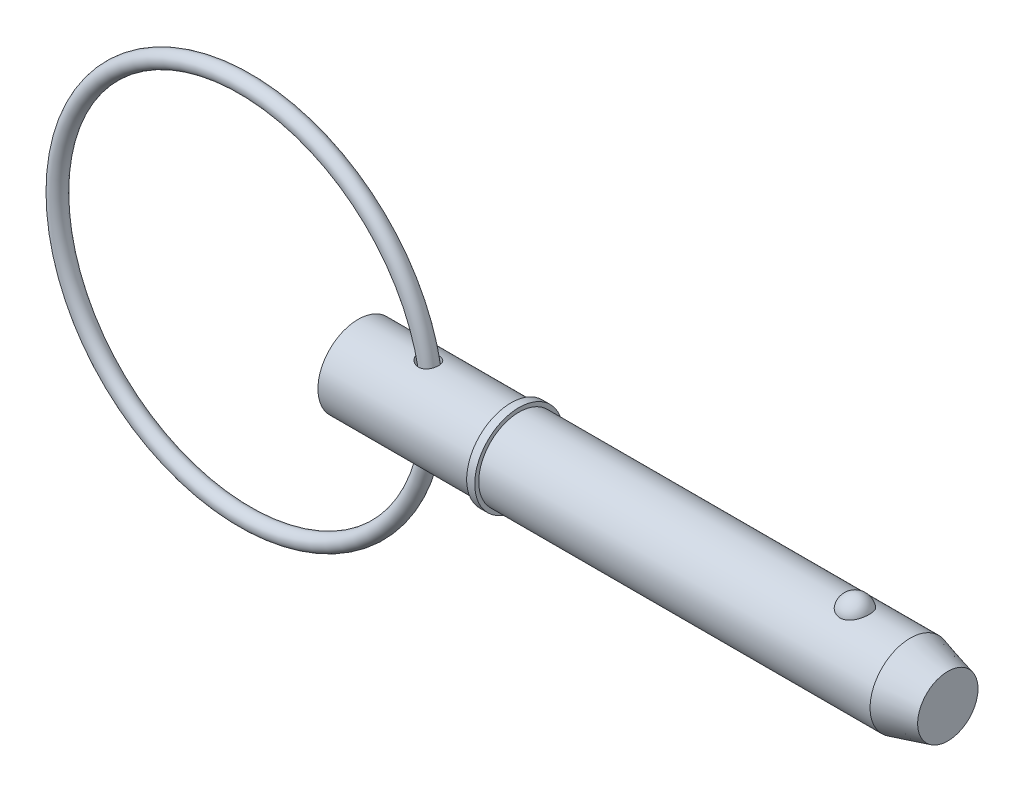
ISO-10303-21;
HEADER;
FILE_DESCRIPTION(('STEP AP214'),'2;1');
FILE_NAME('part.step','',(''),(''),'','','');
FILE_SCHEMA(('AUTOMOTIVE_DESIGN { 1 0 10303 214 1 1 1 1 }'));
ENDSEC;
DATA;
#1=APPLICATION_CONTEXT('core data for automotive mechanical design processes');
#2=APPLICATION_PROTOCOL_DEFINITION('international standard','automotive_design',2000,#1);
#3=PRODUCT_CONTEXT('',#1,'mechanical');
#4=PRODUCT('Part','Part','',(#3));
#5=PRODUCT_RELATED_PRODUCT_CATEGORY('part','',(#4));
#6=PRODUCT_DEFINITION_FORMATION('','',#4);
#7=PRODUCT_DEFINITION_CONTEXT('part definition',#1,'design');
#8=PRODUCT_DEFINITION('design','',#6,#7);
#9=PRODUCT_DEFINITION_SHAPE('','',#8);
#10=(LENGTH_UNIT() NAMED_UNIT(*) SI_UNIT(.MILLI.,.METRE.));
#11=(NAMED_UNIT(*) PLANE_ANGLE_UNIT() SI_UNIT($,.RADIAN.));
#12=(NAMED_UNIT(*) SI_UNIT($,.STERADIAN.) SOLID_ANGLE_UNIT());
#13=UNCERTAINTY_MEASURE_WITH_UNIT(LENGTH_MEASURE(1.E-05),#10,'distance_accuracy_value','');
#14=(GEOMETRIC_REPRESENTATION_CONTEXT(3) GLOBAL_UNCERTAINTY_ASSIGNED_CONTEXT((#13)) GLOBAL_UNIT_ASSIGNED_CONTEXT((#10,
#11,#12)) REPRESENTATION_CONTEXT('',''));
#15=CARTESIAN_POINT('',(0.,0.,0.));
#16=DIRECTION('',(0.,0.,1.));
#17=DIRECTION('',(1.,0.,0.));
#18=AXIS2_PLACEMENT_3D('',#15,#16,#17);
#19=CARTESIAN_POINT('',(-13.4013067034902,0.,0.));
#20=DIRECTION('',(0.,0.,1.));
#21=DIRECTION('',(1.,0.,0.));
#22=AXIS2_PLACEMENT_3D('',#19,#20,#21);
#23=TOROIDAL_SURFACE('',#22,22.225,0.952999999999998);
#24=CARTESIAN_POINT('',(9.77669329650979,0.,0.));
#25=VERTEX_POINT('',#24);
#26=VERTEX_LOOP('',#25);
#27=FACE_BOUND('',#26,.T.);
#28=ADVANCED_FACE('P0_F12',(#27),#23,.T.);
#29=CLOSED_SHELL('',(#28));
#30=MANIFOLD_SOLID_BREP('P0_B1',#29);
#31=CARTESIAN_POINT('',(0.,0.,0.));
#32=DIRECTION('',(1.,0.,0.));
#33=DIRECTION('',(0.,0.,-1.));
#34=AXIS2_PLACEMENT_3D('',#31,#32,#33);
#35=CYLINDRICAL_SURFACE('',#34,4.765);
#36=CARTESIAN_POINT('',(7.48459594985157,4.685973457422,-0.864220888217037));
#37=CARTESIAN_POINT('',(7.53849733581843,4.67711144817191,-0.912273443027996));
#38=CARTESIAN_POINT('',(7.59654891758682,4.66833039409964,-0.955745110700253));
#39=CARTESIAN_POINT('',(7.71924602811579,4.65195567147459,-1.03251233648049));
#40=CARTESIAN_POINT('',(7.78389917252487,4.64436340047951,-1.06579596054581));
#41=CARTESIAN_POINT('',(7.91808098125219,4.63129108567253,-1.12124172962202));
#42=CARTESIAN_POINT('',(7.98761280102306,4.62581242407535,-1.14339659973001));
#43=CARTESIAN_POINT('',(8.12956198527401,4.61771699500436,-1.17566870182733));
#44=CARTESIAN_POINT('',(8.20197774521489,4.61509865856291,-1.18579253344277));
#45=CARTESIAN_POINT('',(8.34550810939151,4.6131791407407,-1.19323853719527));
#46=CARTESIAN_POINT('',(8.41660306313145,4.61378793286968,-1.19090812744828));
#47=CARTESIAN_POINT('',(8.55721866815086,4.61812874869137,-1.17396277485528));
#48=CARTESIAN_POINT('',(8.62673979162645,4.62185982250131,-1.15935156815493));
#49=CARTESIAN_POINT('',(8.75801373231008,4.63172632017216,-1.11925454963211));
#50=CARTESIAN_POINT('',(8.81998342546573,4.63771186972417,-1.09443918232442));
#51=CARTESIAN_POINT('',(8.93863698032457,4.65140179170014,-1.03470792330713));
#52=CARTESIAN_POINT('',(8.99532131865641,4.65910600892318,-0.999792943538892));
#53=CARTESIAN_POINT('',(9.10080884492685,4.67519705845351,-0.921583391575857));
#54=CARTESIAN_POINT('',(9.14973848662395,4.68356861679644,-0.878455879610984));
#55=CARTESIAN_POINT('',(9.23971126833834,4.70019813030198,-0.784620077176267));
#56=CARTESIAN_POINT('',(9.28075401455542,4.7084560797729,-0.733911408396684));
#57=CARTESIAN_POINT('',(9.35441071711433,4.7240688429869,-0.62563775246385));
#58=CARTESIAN_POINT('',(9.38691359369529,4.73141115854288,-0.567995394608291));
#59=CARTESIAN_POINT('',(9.44203216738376,4.74427907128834,-0.447974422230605));
#60=CARTESIAN_POINT('',(9.46464743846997,4.74980459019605,-0.385595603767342));
#61=CARTESIAN_POINT('',(9.49961110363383,4.75848927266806,-0.257248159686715));
#62=CARTESIAN_POINT('',(9.51186382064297,4.76162635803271,-0.191251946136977));
#63=CARTESIAN_POINT('',(9.52545294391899,4.76511165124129,-0.0580729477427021));
#64=CARTESIAN_POINT('',(9.52678936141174,4.76545986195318,0.00910983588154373));
#65=CARTESIAN_POINT('',(9.51851557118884,4.76333054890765,0.142723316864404));
#66=CARTESIAN_POINT('',(9.50891008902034,4.76085424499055,0.209154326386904));
#67=CARTESIAN_POINT('',(9.47899306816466,4.75334441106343,0.339411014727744));
#68=CARTESIAN_POINT('',(9.45868126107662,4.74831081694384,0.403236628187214));
#69=CARTESIAN_POINT('',(9.4078294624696,4.73622777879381,0.526509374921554));
#70=CARTESIAN_POINT('',(9.37728413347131,4.72917728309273,0.585954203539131));
#71=CARTESIAN_POINT('',(9.30671117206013,4.71383320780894,0.698745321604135));
#72=CARTESIAN_POINT('',(9.26668347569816,4.70553961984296,0.752091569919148));
#73=CARTESIAN_POINT('',(9.17821531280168,4.68864637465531,0.851083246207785));
#74=CARTESIAN_POINT('',(9.12978756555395,4.68004719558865,0.896740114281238));
#75=CARTESIAN_POINT('',(9.02575872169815,4.66350833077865,0.97912505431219));
#76=CARTESIAN_POINT('',(8.97015856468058,4.65556855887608,1.01585429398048));
#77=CARTESIAN_POINT('',(8.85409306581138,4.6413534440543,1.0789347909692));
#78=CARTESIAN_POINT('',(8.79369898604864,4.63505812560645,1.10541268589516));
#79=CARTESIAN_POINT('',(8.66918290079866,4.62469916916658,1.1479836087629));
#80=CARTESIAN_POINT('',(8.60506121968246,4.62063533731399,1.1640775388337));
#81=CARTESIAN_POINT('',(8.47537782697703,4.61517348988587,1.18554696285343));
#82=CARTESIAN_POINT('',(8.4098281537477,4.61375835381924,1.19099130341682));
#83=CARTESIAN_POINT('',(8.2786938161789,4.61362908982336,1.19149080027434));
#84=CARTESIAN_POINT('',(8.21310914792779,4.61491539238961,1.18654430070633));
#85=CARTESIAN_POINT('',(8.08152457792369,4.62006017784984,1.16635311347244));
#86=CARTESIAN_POINT('',(8.01557748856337,4.62399895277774,1.15078675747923));
#87=CARTESIAN_POINT('',(7.88704537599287,4.63403793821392,1.10966738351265));
#88=CARTESIAN_POINT('',(7.82446148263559,4.64013886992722,1.08411103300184));
#89=CARTESIAN_POINT('',(7.70057947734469,4.65423592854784,1.02195168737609));
#90=CARTESIAN_POINT('',(7.63957197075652,4.66232221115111,0.984788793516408));
#91=CARTESIAN_POINT('',(7.52457021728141,4.67924552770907,0.900950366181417));
#92=CARTESIAN_POINT('',(7.47057819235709,4.68808279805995,0.854271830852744));
#93=CARTESIAN_POINT('',(7.37028930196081,4.70567913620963,0.751386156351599));
#94=CARTESIAN_POINT('',(7.32416327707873,4.7144333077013,0.695010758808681));
#95=CARTESIAN_POINT('',(7.24276674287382,4.73060166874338,0.574719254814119));
#96=CARTESIAN_POINT('',(7.20749051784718,4.73801656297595,0.510807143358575));
#97=CARTESIAN_POINT('',(7.15148495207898,4.75009927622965,0.381705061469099));
#98=CARTESIAN_POINT('',(7.12994463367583,4.7549169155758,0.31688231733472));
#99=CARTESIAN_POINT('',(7.09904467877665,4.76189692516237,0.184270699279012));
#100=CARTESIAN_POINT('',(7.08967554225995,4.76406136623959,0.116484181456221));
#101=CARTESIAN_POINT('',(7.08394150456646,4.76538257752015,-0.0133529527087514));
#102=CARTESIAN_POINT('',(7.0864533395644,4.76479916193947,-0.0753538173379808));
#103=CARTESIAN_POINT('',(7.10181380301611,4.76127985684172,-0.197993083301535));
#104=CARTESIAN_POINT('',(7.11466291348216,4.75834385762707,-0.258631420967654));
#105=CARTESIAN_POINT('',(7.14973937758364,4.75051877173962,-0.375744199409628));
#106=CARTESIAN_POINT('',(7.17178938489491,4.7456667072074,-0.432274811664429));
#107=CARTESIAN_POINT('',(7.22432962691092,4.73449674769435,-0.54107038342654));
#108=CARTESIAN_POINT('',(7.25481702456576,4.72817934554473,-0.593336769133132));
#109=CARTESIAN_POINT('',(7.31700895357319,4.71588241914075,-0.683642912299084));
#110=CARTESIAN_POINT('',(7.34750058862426,4.7100477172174,-0.722547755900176));
#111=CARTESIAN_POINT('',(7.41288050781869,4.69812059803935,-0.796421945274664));
#112=CARTESIAN_POINT('',(7.44776960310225,4.69202813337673,-0.831390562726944));
#113=CARTESIAN_POINT('',(7.48459594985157,4.685973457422,-0.864220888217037));
#114=B_SPLINE_CURVE_WITH_KNOTS('',3,(#36,#37,#38,#39,#40,#41,#42,#43,#44,#45,#46,#47,#48,#49,
#50,#51,#52,#53,#54,#55,#56,#57,#58,#59,#60,#61,#62,#63,#64,#65,#66,#67,#68,#69,#70,#71,#72,#73,
#74,#75,#76,#77,#78,#79,#80,#81,#82,#83,#84,#85,#86,#87,#88,#89,#90,#91,#92,#93,#94,#95,#96,#97,
#98,#99,#100,#101,#102,#103,#104,#105,#106,#107,#108,#109,#110,#111,#112,#113),.UNSPECIFIED.,
.T.,.F.,(4,2,2,2,2,2,2,2,2,2,2,2,2,2,2,2,2,2,2,2,2,2,2,2,2,2,2,2,2,2,2,2,2,2,2,2,2,2,4),(0.,
0.218078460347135,0.436411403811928,0.654886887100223,0.873242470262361,1.08553925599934,
1.2977714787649,1.49785367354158,1.6979178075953,1.8942789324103,2.09064985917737,
2.28946102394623,2.48828075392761,2.68891673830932,2.88955251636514,3.09010167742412,
3.29065586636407,3.49131482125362,3.69197512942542,3.89233421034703,4.09266707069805,
4.29043955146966,4.48819484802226,4.68466743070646,4.8811713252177,5.08390806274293,
5.28671248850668,5.50140943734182,5.71617422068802,5.93513249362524,6.15397522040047,
6.35827356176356,6.56241234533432,6.74765856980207,6.93291343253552,7.11475139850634,
7.29652829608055,7.44549570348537,7.59449062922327),.UNSPECIFIED.);
#115=CARTESIAN_POINT('',(7.48459594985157,4.685973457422,-0.864220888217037));
#116=VERTEX_POINT('',#115);
#117=EDGE_CURVE('P1_E42',#116,#116,#114,.T.);
#118=ORIENTED_EDGE('',*,*,#117,.T.);
#119=EDGE_LOOP('',(#118));
#120=FACE_BOUND('',#119,.T.);
#121=CARTESIAN_POINT('',(0.,0.,0.));
#122=DIRECTION('',(1.,0.,0.));
#123=DIRECTION('',(0.,0.,-1.));
#124=AXIS2_PLACEMENT_3D('',#121,#122,#123);
#125=CIRCLE('',#124,4.765);
#126=CARTESIAN_POINT('',(0.,0.,-4.765));
#127=VERTEX_POINT('',#126);
#128=EDGE_CURVE('P1_E9',#127,#127,#125,.T.);
#129=ORIENTED_EDGE('',*,*,#128,.T.);
#130=EDGE_LOOP('',(#129));
#131=FACE_BOUND('',#130,.T.);
#132=CARTESIAN_POINT('',(18.097,0.,0.));
#133=DIRECTION('',(1.,0.,0.));
#134=DIRECTION('',(0.,0.,-1.));
#135=AXIS2_PLACEMENT_3D('',#132,#133,#134);
#136=CIRCLE('',#135,4.765);
#137=CARTESIAN_POINT('',(18.097,0.,-4.765));
#138=VERTEX_POINT('',#137);
#139=EDGE_CURVE('P1_E25',#138,#138,#136,.T.);
#140=ORIENTED_EDGE('',*,*,#139,.F.);
#141=EDGE_LOOP('',(#140));
#142=FACE_BOUND('',#141,.T.);
#143=CARTESIAN_POINT('',(7.48459594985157,-4.685973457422,-0.864220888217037));
#144=CARTESIAN_POINT('',(7.43440944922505,-4.6942250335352,-0.819477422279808));
#145=CARTESIAN_POINT('',(7.38778663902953,-4.70255210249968,-0.77073361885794));
#146=CARTESIAN_POINT('',(7.3030968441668,-4.7184989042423,-0.666172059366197));
#147=CARTESIAN_POINT('',(7.26503010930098,-4.72611861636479,-0.610354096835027));
#148=CARTESIAN_POINT('',(7.19878266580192,-4.73983819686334,-0.492624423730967));
#149=CARTESIAN_POINT('',(7.17064194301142,-4.74593188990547,-0.430689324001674));
#150=CARTESIAN_POINT('',(7.12584349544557,-4.75581281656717,-0.3026233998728));
#151=CARTESIAN_POINT('',(7.10917889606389,-4.75960143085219,-0.236495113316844));
#152=CARTESIAN_POINT('',(7.0889853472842,-4.76421379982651,-0.106818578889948));
#153=CARTESIAN_POINT('',(7.0846333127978,-4.76522320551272,-0.0434047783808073));
#154=CARTESIAN_POINT('',(7.08693064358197,-4.7646936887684,0.0832041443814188));
#155=CARTESIAN_POINT('',(7.09357756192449,-4.76315533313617,0.146399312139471));
#156=CARTESIAN_POINT('',(7.11694629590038,-4.75784365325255,0.267709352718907));
#157=CARTESIAN_POINT('',(7.13318365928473,-4.75417793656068,0.325923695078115));
#158=CARTESIAN_POINT('',(7.17459606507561,-4.74508048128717,0.438922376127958));
#159=CARTESIAN_POINT('',(7.19977257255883,-4.73964845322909,0.493706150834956));
#160=CARTESIAN_POINT('',(7.25946789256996,-4.72725615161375,0.60111049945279));
#161=CARTESIAN_POINT('',(7.2943661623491,-4.72023663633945,0.653512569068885));
#162=CARTESIAN_POINT('',(7.37173226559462,-4.70550732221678,0.752279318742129));
#163=CARTESIAN_POINT('',(7.41420315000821,-4.69779724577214,0.798641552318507));
#164=CARTESIAN_POINT('',(7.50982312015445,-4.6816641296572,0.888551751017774));
#165=CARTESIAN_POINT('',(7.56359853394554,-4.67324162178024,0.931434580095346));
#166=CARTESIAN_POINT('',(7.67736628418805,-4.65728554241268,1.00819498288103));
#167=CARTESIAN_POINT('',(7.7373611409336,-4.64975233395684,1.04206888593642));
#168=CARTESIAN_POINT('',(7.86574076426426,-4.63599923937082,1.10169445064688));
#169=CARTESIAN_POINT('',(7.93441048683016,-4.62988111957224,1.12685968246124));
#170=CARTESIAN_POINT('',(8.07519000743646,-4.62035710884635,1.16529928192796));
#171=CARTESIAN_POINT('',(8.14729925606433,-4.61695078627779,1.1785755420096));
#172=CARTESIAN_POINT('',(8.29111621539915,-4.61341807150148,1.19232949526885));
#173=CARTESIAN_POINT('',(8.36279361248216,-4.61321655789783,1.19310032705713));
#174=CARTESIAN_POINT('',(8.50512944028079,-4.61602317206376,1.1821962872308));
#175=CARTESIAN_POINT('',(8.57578827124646,-4.61903000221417,1.17052644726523));
#176=CARTESIAN_POINT('',(8.70965757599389,-4.62766311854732,1.13589249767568));
#177=CARTESIAN_POINT('',(8.77306169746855,-4.63312492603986,1.11363308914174));
#178=CARTESIAN_POINT('',(8.8949702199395,-4.64598463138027,1.05869880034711));
#179=CARTESIAN_POINT('',(8.95347516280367,-4.65338231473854,1.02602507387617));
#180=CARTESIAN_POINT('',(9.06253415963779,-4.66906009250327,0.952097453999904));
#181=CARTESIAN_POINT('',(9.11324728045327,-4.67731427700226,0.911072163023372));
#182=CARTESIAN_POINT('',(9.20707850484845,-4.69393979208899,0.821122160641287));
#183=CARTESIAN_POINT('',(9.25019629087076,-4.70231112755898,0.772197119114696));
#184=CARTESIAN_POINT('',(9.32819072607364,-4.71835356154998,0.667239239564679));
#185=CARTESIAN_POINT('',(9.36297449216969,-4.72601623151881,0.611136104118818));
#186=CARTESIAN_POINT('',(9.42286382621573,-4.73971239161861,0.493799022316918));
#187=CARTESIAN_POINT('',(9.44796891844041,-4.74574580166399,0.432564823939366));
#188=CARTESIAN_POINT('',(9.48811605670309,-4.75559286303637,0.305990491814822));
#189=CARTESIAN_POINT('',(9.50304870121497,-4.75938232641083,0.240613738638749));
#190=CARTESIAN_POINT('',(9.5220569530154,-4.76423188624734,0.108201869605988));
#191=CARTESIAN_POINT('',(9.52613255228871,-4.76529198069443,0.0411667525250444));
#192=CARTESIAN_POINT('',(9.52332772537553,-4.76456884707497,-0.0926701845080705));
#193=CARTESIAN_POINT('',(9.51644541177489,-4.76278512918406,-0.159471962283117));
#194=CARTESIAN_POINT('',(9.49188827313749,-4.75656536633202,-0.290934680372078));
#195=CARTESIAN_POINT('',(9.47421322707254,-4.75212926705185,-0.355595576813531));
#196=CARTESIAN_POINT('',(9.42849503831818,-4.74108318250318,-0.480955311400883));
#197=CARTESIAN_POINT('',(9.4004503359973,-4.73447287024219,-0.541653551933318));
#198=CARTESIAN_POINT('',(9.33467290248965,-4.71979928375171,-0.657361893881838));
#199=CARTESIAN_POINT('',(9.29694000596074,-4.71173598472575,-0.712371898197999));
#200=CARTESIAN_POINT('',(9.2127449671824,-4.69505469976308,-0.815106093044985));
#201=CARTESIAN_POINT('',(9.1662875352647,-4.68643701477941,-0.862834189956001));
#202=CARTESIAN_POINT('',(9.06584125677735,-4.66961864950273,-0.949656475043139));
#203=CARTESIAN_POINT('',(9.01185326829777,-4.66141792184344,-0.98875164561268));
#204=CARTESIAN_POINT('',(8.8985010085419,-4.64646376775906,-1.0567894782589));
#205=CARTESIAN_POINT('',(8.83920621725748,-4.63969468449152,-1.08584444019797));
#206=CARTESIAN_POINT('',(8.71642097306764,-4.62824519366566,-1.13365785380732));
#207=CARTESIAN_POINT('',(8.65293102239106,-4.623564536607,-1.15241753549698));
#208=CARTESIAN_POINT('',(8.52421291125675,-4.61681938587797,-1.17914952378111));
#209=CARTESIAN_POINT('',(8.45900634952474,-4.6147310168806,-1.18722032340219));
#210=CARTESIAN_POINT('',(8.32811210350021,-4.61325848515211,-1.19292878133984));
#211=CARTESIAN_POINT('',(8.26242433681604,-4.61387479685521,-1.19056460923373));
#212=CARTESIAN_POINT('',(8.13057358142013,-4.6177227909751,-1.17555160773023));
#213=CARTESIAN_POINT('',(8.06444352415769,-4.62102282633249,-1.16263394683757));
#214=CARTESIAN_POINT('',(7.93513143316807,-4.62989870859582,-1.12676570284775));
#215=CARTESIAN_POINT('',(7.87194976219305,-4.6354748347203,-1.10381388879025));
#216=CARTESIAN_POINT('',(7.75155849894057,-4.64811746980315,-1.04928030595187));
#217=CARTESIAN_POINT('',(7.69423767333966,-4.65514232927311,-1.01793362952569));
#218=CARTESIAN_POINT('',(7.58503138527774,-4.67007903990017,-0.947046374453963));
#219=CARTESIAN_POINT('',(7.53314612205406,-4.67799092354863,-0.907505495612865));
#220=CARTESIAN_POINT('',(7.48459594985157,-4.685973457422,-0.864220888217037));
#221=B_SPLINE_CURVE_WITH_KNOTS('',3,(#143,#144,#145,#146,#147,#148,#149,#150,#151,#152,#153,
#154,#155,#156,#157,#158,#159,#160,#161,#162,#163,#164,#165,#166,#167,#168,#169,#170,#171,#172,
#173,#174,#175,#176,#177,#178,#179,#180,#181,#182,#183,#184,#185,#186,#187,#188,#189,#190,#191,
#192,#193,#194,#195,#196,#197,#198,#199,#200,#201,#202,#203,#204,#205,#206,#207,#208,#209,#210,
#211,#212,#213,#214,#215,#216,#217,#218,#219,#220),.UNSPECIFIED.,.T.,.F.,(4,2,2,2,2,2,2,2,2,2,2,
2,2,2,2,2,2,2,2,2,2,2,2,2,2,2,2,2,2,2,2,2,2,2,2,2,2,2,4),(0.,0.203013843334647,
0.406033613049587,0.609862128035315,0.813568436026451,1.0032929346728,1.19297523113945,
1.37380897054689,1.55467236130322,1.74393241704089,1.93326889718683,2.14025373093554,
2.3473227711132,2.566425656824,2.78549366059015,2.9994188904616,3.21325763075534,
3.41451842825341,3.61575693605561,3.81208930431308,4.00842987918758,4.20686629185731,
4.40531245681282,4.60586051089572,4.80640871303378,5.0069914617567,5.20757831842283,
5.40819535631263,5.60881581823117,5.80932827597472,6.00981790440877,6.2079863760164,
6.40613116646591,6.60243714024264,6.79877754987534,7.00028133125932,7.20180983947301,
7.39819723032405,7.59459181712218),.UNSPECIFIED.);
#222=CARTESIAN_POINT('',(7.48459594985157,-4.685973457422,-0.864220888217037));
#223=VERTEX_POINT('',#222);
#224=EDGE_CURVE('P1_E17',#223,#223,#221,.T.);
#225=ORIENTED_EDGE('',*,*,#224,.T.);
#226=EDGE_LOOP('',(#225));
#227=FACE_BOUND('',#226,.T.);
#228=ADVANCED_FACE('P1_F13',(#120,#131,#142,#227),#35,.T.);
#229=CARTESIAN_POINT('',(0.,0.,0.));
#230=DIRECTION('',(1.,0.,0.));
#231=DIRECTION('',(0.,0.,-1.));
#232=AXIS2_PLACEMENT_3D('',#229,#230,#231);
#233=CYLINDRICAL_SURFACE('',#232,4.765);
#234=CARTESIAN_POINT('',(65.4041944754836,0.,0.));
#235=DIRECTION('',(1.,0.,0.));
#236=DIRECTION('',(0.,0.,-1.));
#237=AXIS2_PLACEMENT_3D('',#234,#235,#236);
#238=CIRCLE('',#237,4.765);
#239=CARTESIAN_POINT('',(65.4041944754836,0.,-4.765));
#240=VERTEX_POINT('',#239);
#241=EDGE_CURVE('P1_E99',#240,#240,#238,.T.);
#242=ORIENTED_EDGE('',*,*,#241,.F.);
#243=EDGE_LOOP('',(#242));
#244=FACE_BOUND('',#243,.T.);
#245=CARTESIAN_POINT('',(19.05,0.,0.));
#246=DIRECTION('',(1.,0.,0.));
#247=DIRECTION('',(0.,0.,-1.));
#248=AXIS2_PLACEMENT_3D('',#245,#246,#247);
#249=CIRCLE('',#248,4.765);
#250=CARTESIAN_POINT('',(19.05,0.,-4.765));
#251=VERTEX_POINT('',#250);
#252=EDGE_CURVE('P1_E96',#251,#251,#249,.T.);
#253=ORIENTED_EDGE('',*,*,#252,.T.);
#254=EDGE_LOOP('',(#253));
#255=FACE_BOUND('',#254,.T.);
#256=CARTESIAN_POINT('',(58.8510202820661,4.42764777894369,1.76101111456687));
#257=CARTESIAN_POINT('',(58.7597212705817,4.42764470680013,1.76101422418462));
#258=CARTESIAN_POINT('',(58.6684468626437,4.4305909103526,1.75366340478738));
#259=CARTESIAN_POINT('',(58.4886154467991,4.44201846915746,1.72451180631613));
#260=CARTESIAN_POINT('',(58.4000577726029,4.45049845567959,1.70271460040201));
#261=CARTESIAN_POINT('',(58.2282570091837,4.47200516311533,1.6453937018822));
#262=CARTESIAN_POINT('',(58.1450064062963,4.48502527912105,1.60988994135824));
#263=CARTESIAN_POINT('',(57.9857633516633,4.51419542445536,1.52617873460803));
#264=CARTESIAN_POINT('',(57.9097723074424,4.53034605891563,1.47796883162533));
#265=CARTESIAN_POINT('',(57.764744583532,4.5645931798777,1.36860494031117));
#266=CARTESIAN_POINT('',(57.6959645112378,4.58273170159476,1.3071242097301));
#267=CARTESIAN_POINT('',(57.5693423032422,4.61870302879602,1.17370204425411));
#268=CARTESIAN_POINT('',(57.5115021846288,4.63653577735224,1.10175868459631));
#269=CARTESIAN_POINT('',(57.405570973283,4.67090140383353,0.945806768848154));
#270=CARTESIAN_POINT('',(57.3580305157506,4.68734068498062,0.861402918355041));
#271=CARTESIAN_POINT('',(57.2770817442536,4.71628466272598,0.685442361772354));
#272=CARTESIAN_POINT('',(57.2436747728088,4.72878898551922,0.593884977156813));
#273=CARTESIAN_POINT('',(57.191287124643,4.74874061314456,0.404781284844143));
#274=CARTESIAN_POINT('',(57.1725178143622,4.75611366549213,0.307168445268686));
#275=CARTESIAN_POINT('',(57.1505846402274,4.76475393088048,0.109940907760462));
#276=CARTESIAN_POINT('',(57.1474205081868,4.76602124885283,0.0103262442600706));
#277=CARTESIAN_POINT('',(57.1567405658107,4.76232928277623,-0.187629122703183));
#278=CARTESIAN_POINT('',(57.1691588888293,4.7573962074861,-0.285973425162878));
#279=CARTESIAN_POINT('',(57.2092804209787,4.74184975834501,-0.479027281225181));
#280=CARTESIAN_POINT('',(57.2369839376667,4.7312362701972,-0.573736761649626));
#281=CARTESIAN_POINT('',(57.3071581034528,4.70540026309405,-0.756973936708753));
#282=CARTESIAN_POINT('',(57.3496460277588,4.69017235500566,-0.845494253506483));
#283=CARTESIAN_POINT('',(57.448520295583,4.6566986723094,-1.01378033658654));
#284=CARTESIAN_POINT('',(57.5049076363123,4.63845268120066,-1.09354547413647));
#285=CARTESIAN_POINT('',(57.630552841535,4.60085438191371,-1.24228523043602));
#286=CARTESIAN_POINT('',(57.6998439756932,4.58149930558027,-1.31123108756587));
#287=CARTESIAN_POINT('',(57.8496066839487,4.54391653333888,-1.43607409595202));
#288=CARTESIAN_POINT('',(57.9300771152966,4.52568872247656,-1.49197257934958));
#289=CARTESIAN_POINT('',(58.0981500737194,4.49293007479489,-1.58786764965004));
#290=CARTESIAN_POINT('',(58.1855445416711,4.47832346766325,-1.62820219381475));
#291=CARTESIAN_POINT('',(58.366553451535,4.45406011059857,-1.69345757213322));
#292=CARTESIAN_POINT('',(58.4601655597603,4.44440151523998,-1.71838415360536));
#293=CARTESIAN_POINT('',(58.6458939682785,4.43159888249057,-1.7511284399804));
#294=CARTESIAN_POINT('',(58.737849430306,4.42815213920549,-1.75974223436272));
#295=CARTESIAN_POINT('',(58.9219658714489,4.427247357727,-1.76201865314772));
#296=CARTESIAN_POINT('',(59.0141268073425,4.42978816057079,-1.75568417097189));
#297=CARTESIAN_POINT('',(59.1931292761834,4.4403864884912,-1.72869560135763));
#298=CARTESIAN_POINT('',(59.2800474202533,4.44827555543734,-1.70847853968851));
#299=CARTESIAN_POINT('',(59.4491314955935,4.46852246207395,-1.65479562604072));
#300=CARTESIAN_POINT('',(59.5312970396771,4.48088066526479,-1.62132869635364));
#301=CARTESIAN_POINT('',(59.6905916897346,4.50907357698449,-1.54120560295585));
#302=CARTESIAN_POINT('',(59.7675700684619,4.52497884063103,-1.49427526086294));
#303=CARTESIAN_POINT('',(59.9127080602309,4.55845148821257,-1.38881222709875));
#304=CARTESIAN_POINT('',(59.9808656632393,4.57601924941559,-1.33027689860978));
#305=CARTESIAN_POINT('',(60.1100990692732,4.61196537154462,-1.19991049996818));
#306=CARTESIAN_POINT('',(60.1706562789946,4.63034074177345,-1.12756415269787));
#307=CARTESIAN_POINT('',(60.2792797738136,4.66513959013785,-0.973612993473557));
#308=CARTESIAN_POINT('',(60.3273438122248,4.68156271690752,-0.892006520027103));
#309=CARTESIAN_POINT('',(60.411383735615,4.71130224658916,-0.718892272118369));
#310=CARTESIAN_POINT('',(60.4469185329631,4.724501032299,-0.627149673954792));
#311=CARTESIAN_POINT('',(60.5029522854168,4.74571823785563,-0.438611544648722));
#312=CARTESIAN_POINT('',(60.523450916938,4.75373654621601,-0.341815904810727));
#313=CARTESIAN_POINT('',(60.5490338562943,4.76378905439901,-0.145633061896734));
#314=CARTESIAN_POINT('',(60.554076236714,4.76580697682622,-0.046239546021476));
#315=CARTESIAN_POINT('',(60.5485239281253,4.76360573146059,0.152038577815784));
#316=CARTESIAN_POINT('',(60.5379294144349,4.75938663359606,0.250923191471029));
#317=CARTESIAN_POINT('',(60.5013875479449,4.74516937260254,0.445004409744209));
#318=CARTESIAN_POINT('',(60.4754964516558,4.73519238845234,0.540213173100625));
#319=CARTESIAN_POINT('',(60.4089273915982,4.71049394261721,0.724662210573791));
#320=CARTESIAN_POINT('',(60.368248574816,4.69577220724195,0.813902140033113));
#321=CARTESIAN_POINT('',(60.2727177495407,4.66303767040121,0.984313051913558));
#322=CARTESIAN_POINT('',(60.2178042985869,4.64501070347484,1.06544688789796));
#323=CARTESIAN_POINT('',(60.0950496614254,4.60764678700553,1.21692673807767));
#324=CARTESIAN_POINT('',(60.0272086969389,4.58830985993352,1.28727293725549));
#325=CARTESIAN_POINT('',(59.8805480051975,4.55060370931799,1.41479271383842));
#326=CARTESIAN_POINT('',(59.8017918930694,4.53222967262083,1.4720378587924));
#327=CARTESIAN_POINT('',(59.6349890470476,4.49849576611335,1.57212016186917));
#328=CARTESIAN_POINT('',(59.5469417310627,4.48313608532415,1.6149564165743));
#329=CARTESIAN_POINT('',(59.3597918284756,4.45676184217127,1.68642657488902));
#330=CARTESIAN_POINT('',(59.2603653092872,4.44598302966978,1.71430590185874));
#331=CARTESIAN_POINT('',(59.0576210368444,4.43142918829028,1.7515925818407));
#332=CARTESIAN_POINT('',(58.9543049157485,4.42765125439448,1.76100759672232));
#333=CARTESIAN_POINT('',(58.8510202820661,4.42764777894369,1.76101111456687));
#334=B_SPLINE_CURVE_WITH_KNOTS('',3,(#256,#257,#258,#259,#260,#261,#262,#263,#264,#265,#266,
#267,#268,#269,#270,#271,#272,#273,#274,#275,#276,#277,#278,#279,#280,#281,#282,#283,#284,#285,
#286,#287,#288,#289,#290,#291,#292,#293,#294,#295,#296,#297,#298,#299,#300,#301,#302,#303,#304,
#305,#306,#307,#308,#309,#310,#311,#312,#313,#314,#315,#316,#317,#318,#319,#320,#321,#322,#323,
#324,#325,#326,#327,#328,#329,#330,#331,#332,#333),.UNSPECIFIED.,.T.,.F.,(4,2,2,2,2,2,2,2,2,2,2,
2,2,2,2,2,2,2,2,2,2,2,2,2,2,2,2,2,2,2,2,2,2,2,2,2,2,2,4),(0.,0.273517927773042,
0.546968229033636,0.820022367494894,1.09312934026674,1.37393946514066,1.6548013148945,
1.94820420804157,2.24163496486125,2.53922817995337,2.83681628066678,3.13315071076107,
3.42949110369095,3.72617893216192,4.02288805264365,4.32037303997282,4.61782764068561,
4.90840095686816,5.19886582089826,5.47474855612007,5.75057789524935,6.01809977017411,
6.28564340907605,6.55907787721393,6.83257454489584,7.11962987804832,7.40673679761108,
7.70312663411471,7.99952284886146,8.29672237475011,8.59391856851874,8.89002850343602,
9.1861555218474,9.48358266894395,9.78100471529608,10.0767610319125,10.3725358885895,
10.6820893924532,10.991514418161),.UNSPECIFIED.);
#335=CARTESIAN_POINT('',(58.8510202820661,4.42764777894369,1.76101111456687));
#336=VERTEX_POINT('',#335);
#337=EDGE_CURVE('P1_E34',#336,#336,#334,.T.);
#338=ORIENTED_EDGE('',*,*,#337,.T.);
#339=EDGE_LOOP('',(#338));
#340=FACE_BOUND('',#339,.T.);
#341=ADVANCED_FACE('P1_F46',(#244,#255,#340),#233,.T.);
#342=CARTESIAN_POINT('',(0.,0.,0.));
#343=DIRECTION('',(-1.,0.,0.));
#344=DIRECTION('',(0.,0.,1.));
#345=AXIS2_PLACEMENT_3D('',#342,#343,#344);
#346=PLANE('',#345);
#347=ORIENTED_EDGE('',*,*,#128,.F.);
#348=EDGE_LOOP('',(#347));
#349=FACE_BOUND('',#348,.T.);
#350=ADVANCED_FACE('P1_F15',(#349),#346,.T.);
#351=CARTESIAN_POINT('',(18.097,4.765,0.));
#352=DIRECTION('',(-1.,0.,0.));
#353=DIRECTION('',(0.,0.,1.));
#354=AXIS2_PLACEMENT_3D('',#351,#352,#353);
#355=PLANE('',#354);
#356=ORIENTED_EDGE('',*,*,#139,.T.);
#357=EDGE_LOOP('',(#356));
#358=FACE_BOUND('',#357,.T.);
#359=CARTESIAN_POINT('',(18.097,0.,0.));
#360=DIRECTION('',(1.,0.,0.));
#361=DIRECTION('',(0.,0.,-1.));
#362=AXIS2_PLACEMENT_3D('',#359,#360,#361);
#363=CIRCLE('',#362,5.2415);
#364=CARTESIAN_POINT('',(18.097,0.,-5.2415));
#365=VERTEX_POINT('',#364);
#366=EDGE_CURVE('P1_E30',#365,#365,#363,.T.);
#367=ORIENTED_EDGE('',*,*,#366,.F.);
#368=EDGE_LOOP('',(#367));
#369=FACE_BOUND('',#368,.T.);
#370=ADVANCED_FACE('P1_F81',(#358,#369),#355,.T.);
#371=CARTESIAN_POINT('',(0.,0.,0.));
#372=DIRECTION('',(1.,0.,0.));
#373=DIRECTION('',(0.,0.,-1.));
#374=AXIS2_PLACEMENT_3D('',#371,#372,#373);
#375=CYLINDRICAL_SURFACE('',#374,5.2415);
#376=ORIENTED_EDGE('',*,*,#366,.T.);
#377=EDGE_LOOP('',(#376));
#378=FACE_BOUND('',#377,.T.);
#379=CARTESIAN_POINT('',(19.05,0.,0.));
#380=DIRECTION('',(1.,0.,0.));
#381=DIRECTION('',(0.,0.,-1.));
#382=AXIS2_PLACEMENT_3D('',#379,#380,#381);
#383=CIRCLE('',#382,5.2415);
#384=CARTESIAN_POINT('',(19.05,0.,-5.2415));
#385=VERTEX_POINT('',#384);
#386=EDGE_CURVE('P1_E95',#385,#385,#383,.T.);
#387=ORIENTED_EDGE('',*,*,#386,.F.);
#388=EDGE_LOOP('',(#387));
#389=FACE_BOUND('',#388,.T.);
#390=ADVANCED_FACE('P1_F68',(#378,#389),#375,.T.);
#391=CARTESIAN_POINT('',(19.05,5.2415,0.));
#392=DIRECTION('',(1.,0.,0.));
#393=DIRECTION('',(0.,0.,-1.));
#394=AXIS2_PLACEMENT_3D('',#391,#392,#393);
#395=PLANE('',#394);
#396=ORIENTED_EDGE('',*,*,#386,.T.);
#397=EDGE_LOOP('',(#396));
#398=FACE_BOUND('',#397,.T.);
#399=ORIENTED_EDGE('',*,*,#252,.F.);
#400=EDGE_LOOP('',(#399));
#401=FACE_BOUND('',#400,.T.);
#402=ADVANCED_FACE('P1_F62',(#398,#401),#395,.T.);
#403=CARTESIAN_POINT('',(69.85,0.,0.));
#404=DIRECTION('',(-1.,0.,0.));
#405=DIRECTION('',(0.,0.,1.));
#406=AXIS2_PLACEMENT_3D('',#403,#404,#405);
#407=CONICAL_SURFACE('',#406,3.57375000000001,0.26179938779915);
#408=ORIENTED_EDGE('',*,*,#241,.T.);
#409=EDGE_LOOP('',(#408));
#410=FACE_BOUND('',#409,.T.);
#411=CARTESIAN_POINT('',(69.85,0.,0.));
#412=DIRECTION('',(1.,0.,0.));
#413=DIRECTION('',(0.,0.,-1.));
#414=AXIS2_PLACEMENT_3D('',#411,#412,#413);
#415=CIRCLE('',#414,3.57375000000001);
#416=CARTESIAN_POINT('',(69.85,0.,-3.57375000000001));
#417=VERTEX_POINT('',#416);
#418=EDGE_CURVE('P1_E41',#417,#417,#415,.T.);
#419=ORIENTED_EDGE('',*,*,#418,.F.);
#420=EDGE_LOOP('',(#419));
#421=FACE_BOUND('',#420,.T.);
#422=ADVANCED_FACE('P1_F59',(#410,#421),#407,.T.);
#423=CARTESIAN_POINT('',(69.85,3.57375000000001,0.));
#424=DIRECTION('',(1.,0.,0.));
#425=DIRECTION('',(0.,0.,-1.));
#426=AXIS2_PLACEMENT_3D('',#423,#424,#425);
#427=PLANE('',#426);
#428=ORIENTED_EDGE('',*,*,#418,.T.);
#429=EDGE_LOOP('',(#428));
#430=FACE_BOUND('',#429,.T.);
#431=ADVANCED_FACE('P1_F55',(#430),#427,.T.);
#432=CARTESIAN_POINT('',(58.8510202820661,4.28849999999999,0.));
#433=DIRECTION('',(-1.,0.,0.));
#434=DIRECTION('',(0.,-1.,0.));
#435=AXIS2_PLACEMENT_3D('',#432,#433,#434);
#436=SPHERICAL_SURFACE('',#435,1.7665);
#437=ORIENTED_EDGE('',*,*,#337,.F.);
#438=EDGE_LOOP('',(#437));
#439=FACE_BOUND('',#438,.T.);
#440=ADVANCED_FACE('P1_F50',(#439),#436,.T.);
#441=CARTESIAN_POINT('',(-13.4013067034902,0.,0.));
#442=DIRECTION('',(0.,0.,1.));
#443=DIRECTION('',(1.,0.,0.));
#444=AXIS2_PLACEMENT_3D('',#441,#442,#443);
#445=TOROIDAL_SURFACE('',#444,22.225,1.19125);
#446=ORIENTED_EDGE('',*,*,#224,.F.);
#447=EDGE_LOOP('',(#446));
#448=FACE_BOUND('',#447,.T.);
#449=ORIENTED_EDGE('',*,*,#117,.F.);
#450=EDGE_LOOP('',(#449));
#451=FACE_BOUND('',#450,.T.);
#452=ADVANCED_FACE('P1_F54',(#448,#451),#445,.F.);
#453=CLOSED_SHELL('',(#228,#341,#350,#370,#390,#402,#422,#431,#440,#452));
#454=MANIFOLD_SOLID_BREP('P1_B1',#453);
#455=ADVANCED_BREP_SHAPE_REPRESENTATION('',(#18,#30,#454),#14);
#456=SHAPE_DEFINITION_REPRESENTATION(#9,#455);
ENDSEC;
END-ISO-10303-21;
